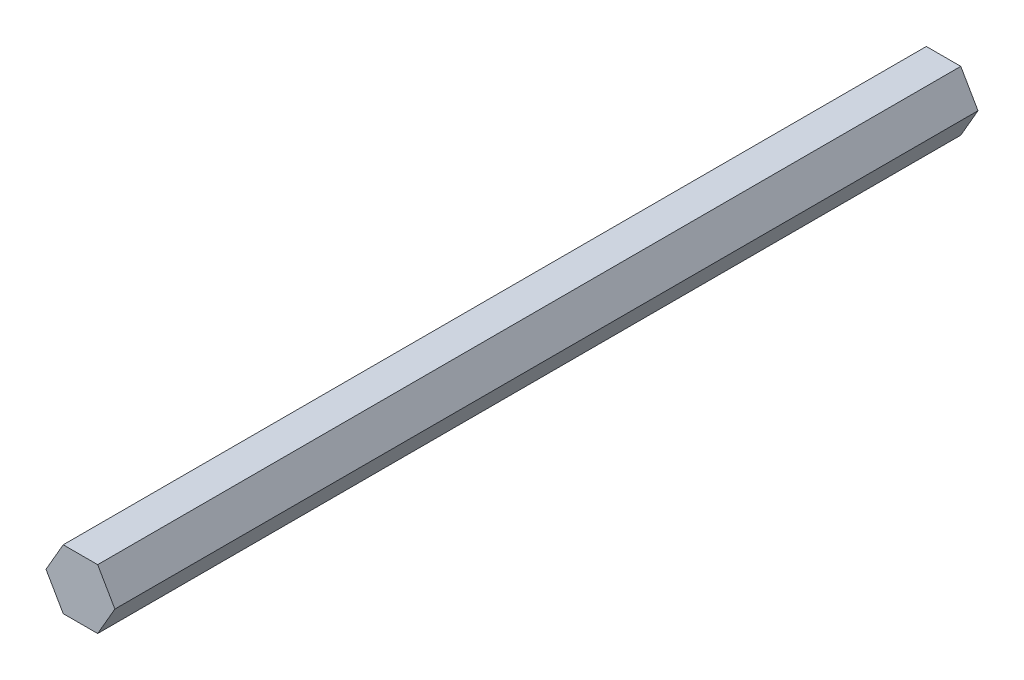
ISO-10303-21;
HEADER;
FILE_DESCRIPTION(('STEP AP214'),'2;1');
FILE_NAME('part.step','',(''),(''),'','','');
FILE_SCHEMA(('AUTOMOTIVE_DESIGN { 1 0 10303 214 1 1 1 1 }'));
ENDSEC;
DATA;
#1=APPLICATION_CONTEXT('core data for automotive mechanical design processes');
#2=APPLICATION_PROTOCOL_DEFINITION('international standard','automotive_design',2000,#1);
#3=PRODUCT_CONTEXT('',#1,'mechanical');
#4=PRODUCT('Part','Part','',(#3));
#5=PRODUCT_RELATED_PRODUCT_CATEGORY('part','',(#4));
#6=PRODUCT_DEFINITION_FORMATION('','',#4);
#7=PRODUCT_DEFINITION_CONTEXT('part definition',#1,'design');
#8=PRODUCT_DEFINITION('design','',#6,#7);
#9=PRODUCT_DEFINITION_SHAPE('','',#8);
#10=(LENGTH_UNIT() NAMED_UNIT(*) SI_UNIT(.MILLI.,.METRE.));
#11=(NAMED_UNIT(*) PLANE_ANGLE_UNIT() SI_UNIT($,.RADIAN.));
#12=(NAMED_UNIT(*) SI_UNIT($,.STERADIAN.) SOLID_ANGLE_UNIT());
#13=UNCERTAINTY_MEASURE_WITH_UNIT(LENGTH_MEASURE(1.E-05),#10,'distance_accuracy_value','');
#14=(GEOMETRIC_REPRESENTATION_CONTEXT(3) GLOBAL_UNCERTAINTY_ASSIGNED_CONTEXT((#13)) GLOBAL_UNIT_ASSIGNED_CONTEXT((#10,
#11,#12)) REPRESENTATION_CONTEXT('',''));
#15=CARTESIAN_POINT('',(0.,0.,0.));
#16=DIRECTION('',(0.,0.,1.));
#17=DIRECTION('',(1.,0.,0.));
#18=AXIS2_PLACEMENT_3D('',#15,#16,#17);
#19=CARTESIAN_POINT('',(1.35677313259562,2.35,0.));
#20=DIRECTION('',(0.866025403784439,0.5,0.));
#21=DIRECTION('',(-0.5,0.866025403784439,0.));
#22=AXIS2_PLACEMENT_3D('',#19,#20,#21);
#23=PLANE('',#22);
#24=DIRECTION('',(-0.5,0.866025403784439,0.));
#25=VECTOR('',#24,1.);
#26=CARTESIAN_POINT('',(2.71354626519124,0.,0.));
#27=LINE('',#26,#25);
#28=CARTESIAN_POINT('',(2.71354626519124,0.,0.));
#29=VERTEX_POINT('',#28);
#30=CARTESIAN_POINT('',(1.35677313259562,2.35,0.));
#31=VERTEX_POINT('',#30);
#32=EDGE_CURVE('E103',#29,#31,#27,.T.);
#33=ORIENTED_EDGE('',*,*,#32,.T.);
#34=DIRECTION('',(0.,0.,1.));
#35=VECTOR('',#34,1.);
#36=CARTESIAN_POINT('',(1.35677313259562,2.35,0.));
#37=LINE('',#36,#35);
#38=CARTESIAN_POINT('',(1.35677313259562,2.35,68.));
#39=VERTEX_POINT('',#38);
#40=EDGE_CURVE('E78',#39,#31,#37,.F.);
#41=ORIENTED_EDGE('',*,*,#40,.F.);
#42=DIRECTION('',(-0.5,0.866025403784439,0.));
#43=VECTOR('',#42,1.);
#44=CARTESIAN_POINT('',(2.71354626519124,0.,68.));
#45=LINE('',#44,#43);
#46=CARTESIAN_POINT('',(2.71354626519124,0.,68.));
#47=VERTEX_POINT('',#46);
#48=EDGE_CURVE('E74',#47,#39,#45,.T.);
#49=ORIENTED_EDGE('',*,*,#48,.F.);
#50=DIRECTION('',(0.,0.,1.));
#51=VECTOR('',#50,1.);
#52=CARTESIAN_POINT('',(2.71354626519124,0.,0.));
#53=LINE('',#52,#51);
#54=EDGE_CURVE('E76',#29,#47,#53,.T.);
#55=ORIENTED_EDGE('',*,*,#54,.F.);
#56=EDGE_LOOP('',(#33,#41,#49,#55));
#57=FACE_BOUND('',#56,.T.);
#58=ADVANCED_FACE('F15',(#57),#23,.T.);
#59=CARTESIAN_POINT('',(-1.35677313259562,2.35,0.));
#60=DIRECTION('',(0.,1.,0.));
#61=DIRECTION('',(0.,0.,1.));
#62=AXIS2_PLACEMENT_3D('',#59,#60,#61);
#63=PLANE('',#62);
#64=DIRECTION('',(1.,0.,0.));
#65=VECTOR('',#64,1.);
#66=CARTESIAN_POINT('',(0.,2.35,0.));
#67=LINE('',#66,#65);
#68=CARTESIAN_POINT('',(-1.35677313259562,2.35,0.));
#69=VERTEX_POINT('',#68);
#70=EDGE_CURVE('E100',#31,#69,#67,.F.);
#71=ORIENTED_EDGE('',*,*,#70,.T.);
#72=DIRECTION('',(0.,0.,1.));
#73=VECTOR('',#72,1.);
#74=CARTESIAN_POINT('',(-1.35677313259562,2.35,0.));
#75=LINE('',#74,#73);
#76=CARTESIAN_POINT('',(-1.35677313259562,2.35,68.));
#77=VERTEX_POINT('',#76);
#78=EDGE_CURVE('E93',#77,#69,#75,.F.);
#79=ORIENTED_EDGE('',*,*,#78,.F.);
#80=DIRECTION('',(1.,0.,0.));
#81=VECTOR('',#80,1.);
#82=CARTESIAN_POINT('',(0.,2.35,68.));
#83=LINE('',#82,#81);
#84=EDGE_CURVE('E81',#39,#77,#83,.F.);
#85=ORIENTED_EDGE('',*,*,#84,.F.);
#86=ORIENTED_EDGE('',*,*,#40,.T.);
#87=EDGE_LOOP('',(#71,#79,#85,#86));
#88=FACE_BOUND('',#87,.T.);
#89=ADVANCED_FACE('F135',(#88),#63,.T.);
#90=CARTESIAN_POINT('',(2.71354626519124,0.,0.));
#91=DIRECTION('',(0.866025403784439,-0.5,0.));
#92=DIRECTION('',(0.5,0.866025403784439,0.));
#93=AXIS2_PLACEMENT_3D('',#90,#91,#92);
#94=PLANE('',#93);
#95=DIRECTION('',(0.5,0.866025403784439,0.));
#96=VECTOR('',#95,1.);
#97=CARTESIAN_POINT('',(1.35677313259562,-2.35,0.));
#98=LINE('',#97,#96);
#99=CARTESIAN_POINT('',(1.35677313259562,-2.35,0.));
#100=VERTEX_POINT('',#99);
#101=EDGE_CURVE('E51',#100,#29,#98,.T.);
#102=ORIENTED_EDGE('',*,*,#101,.T.);
#103=ORIENTED_EDGE('',*,*,#54,.T.);
#104=DIRECTION('',(0.5,0.866025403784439,0.));
#105=VECTOR('',#104,1.);
#106=CARTESIAN_POINT('',(1.35677313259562,-2.35,68.));
#107=LINE('',#106,#105);
#108=CARTESIAN_POINT('',(1.35677313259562,-2.35,68.));
#109=VERTEX_POINT('',#108);
#110=EDGE_CURVE('E85',#109,#47,#107,.T.);
#111=ORIENTED_EDGE('',*,*,#110,.F.);
#112=DIRECTION('',(0.,0.,-1.));
#113=VECTOR('',#112,1.);
#114=CARTESIAN_POINT('',(1.35677313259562,-2.35,0.));
#115=LINE('',#114,#113);
#116=EDGE_CURVE('E107',#100,#109,#115,.F.);
#117=ORIENTED_EDGE('',*,*,#116,.F.);
#118=EDGE_LOOP('',(#102,#103,#111,#117));
#119=FACE_BOUND('',#118,.T.);
#120=ADVANCED_FACE('F84',(#119),#94,.T.);
#121=CARTESIAN_POINT('',(0.,0.,68.));
#122=DIRECTION('',(0.,0.,1.));
#123=DIRECTION('',(1.,0.,0.));
#124=AXIS2_PLACEMENT_3D('',#121,#122,#123);
#125=PLANE('',#124);
#126=DIRECTION('',(1.,0.,0.));
#127=VECTOR('',#126,1.);
#128=CARTESIAN_POINT('',(1.35677313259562,-2.35,68.));
#129=LINE('',#128,#127);
#130=CARTESIAN_POINT('',(-1.35677313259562,-2.35,68.));
#131=VERTEX_POINT('',#130);
#132=EDGE_CURVE('E88',#109,#131,#129,.F.);
#133=ORIENTED_EDGE('',*,*,#132,.F.);
#134=ORIENTED_EDGE('',*,*,#110,.T.);
#135=ORIENTED_EDGE('',*,*,#48,.T.);
#136=ORIENTED_EDGE('',*,*,#84,.T.);
#137=DIRECTION('',(-0.500000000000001,-0.866025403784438,0.));
#138=VECTOR('',#137,1.);
#139=CARTESIAN_POINT('',(-2.71354626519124,0.,68.));
#140=LINE('',#139,#138);
#141=CARTESIAN_POINT('',(-2.71354626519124,0.,68.));
#142=VERTEX_POINT('',#141);
#143=EDGE_CURVE('E90',#142,#77,#140,.F.);
#144=ORIENTED_EDGE('',*,*,#143,.F.);
#145=DIRECTION('',(0.5,-0.866025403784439,0.));
#146=VECTOR('',#145,1.);
#147=CARTESIAN_POINT('',(-1.35677313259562,-2.35,68.));
#148=LINE('',#147,#146);
#149=EDGE_CURVE('E19',#131,#142,#148,.F.);
#150=ORIENTED_EDGE('',*,*,#149,.F.);
#151=EDGE_LOOP('',(#133,#134,#135,#136,#144,#150));
#152=FACE_BOUND('',#151,.T.);
#153=ADVANCED_FACE('F87',(#152),#125,.T.);
#154=CARTESIAN_POINT('',(-2.71354626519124,0.,0.));
#155=DIRECTION('',(-0.866025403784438,0.500000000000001,0.));
#156=DIRECTION('',(-0.500000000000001,-0.866025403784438,0.));
#157=AXIS2_PLACEMENT_3D('',#154,#155,#156);
#158=PLANE('',#157);
#159=DIRECTION('',(-0.500000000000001,-0.866025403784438,0.));
#160=VECTOR('',#159,1.);
#161=CARTESIAN_POINT('',(-1.35677313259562,2.35,0.));
#162=LINE('',#161,#160);
#163=CARTESIAN_POINT('',(-2.71354626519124,0.,0.));
#164=VERTEX_POINT('',#163);
#165=EDGE_CURVE('E98',#69,#164,#162,.T.);
#166=ORIENTED_EDGE('',*,*,#165,.T.);
#167=DIRECTION('',(0.,0.,1.));
#168=VECTOR('',#167,1.);
#169=CARTESIAN_POINT('',(-2.71354626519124,0.,0.));
#170=LINE('',#169,#168);
#171=EDGE_CURVE('E112',#142,#164,#170,.F.);
#172=ORIENTED_EDGE('',*,*,#171,.F.);
#173=ORIENTED_EDGE('',*,*,#143,.T.);
#174=ORIENTED_EDGE('',*,*,#78,.T.);
#175=EDGE_LOOP('',(#166,#172,#173,#174));
#176=FACE_BOUND('',#175,.T.);
#177=ADVANCED_FACE('F125',(#176),#158,.T.);
#178=CARTESIAN_POINT('',(0.,0.,0.));
#179=DIRECTION('',(0.,0.,1.));
#180=DIRECTION('',(1.,0.,0.));
#181=AXIS2_PLACEMENT_3D('',#178,#179,#180);
#182=PLANE('',#181);
#183=ORIENTED_EDGE('',*,*,#32,.F.);
#184=ORIENTED_EDGE('',*,*,#101,.F.);
#185=DIRECTION('',(1.,0.,0.));
#186=VECTOR('',#185,1.);
#187=CARTESIAN_POINT('',(1.35677313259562,-2.35,0.));
#188=LINE('',#187,#186);
#189=CARTESIAN_POINT('',(-1.35677313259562,-2.35,0.));
#190=VERTEX_POINT('',#189);
#191=EDGE_CURVE('E34',#190,#100,#188,.T.);
#192=ORIENTED_EDGE('',*,*,#191,.F.);
#193=DIRECTION('',(0.5,-0.866025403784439,0.));
#194=VECTOR('',#193,1.);
#195=CARTESIAN_POINT('',(-1.35677313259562,-2.35,0.));
#196=LINE('',#195,#194);
#197=EDGE_CURVE('E25',#164,#190,#196,.T.);
#198=ORIENTED_EDGE('',*,*,#197,.F.);
#199=ORIENTED_EDGE('',*,*,#165,.F.);
#200=ORIENTED_EDGE('',*,*,#70,.F.);
#201=EDGE_LOOP('',(#183,#184,#192,#198,#199,#200));
#202=FACE_BOUND('',#201,.T.);
#203=ADVANCED_FACE('F119',(#202),#182,.F.);
#204=CARTESIAN_POINT('',(1.35677313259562,-2.35,0.));
#205=DIRECTION('',(0.,-1.,0.));
#206=DIRECTION('',(0.,0.,-1.));
#207=AXIS2_PLACEMENT_3D('',#204,#205,#206);
#208=PLANE('',#207);
#209=ORIENTED_EDGE('',*,*,#191,.T.);
#210=ORIENTED_EDGE('',*,*,#116,.T.);
#211=ORIENTED_EDGE('',*,*,#132,.T.);
#212=DIRECTION('',(0.,0.,1.));
#213=VECTOR('',#212,1.);
#214=CARTESIAN_POINT('',(-1.35677313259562,-2.35,0.));
#215=LINE('',#214,#213);
#216=EDGE_CURVE('E10',#190,#131,#215,.T.);
#217=ORIENTED_EDGE('',*,*,#216,.F.);
#218=EDGE_LOOP('',(#209,#210,#211,#217));
#219=FACE_BOUND('',#218,.T.);
#220=ADVANCED_FACE('F117',(#219),#208,.T.);
#221=CARTESIAN_POINT('',(-1.35677313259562,-2.35,0.));
#222=DIRECTION('',(-0.866025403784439,-0.5,0.));
#223=DIRECTION('',(0.5,-0.866025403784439,0.));
#224=AXIS2_PLACEMENT_3D('',#221,#222,#223);
#225=PLANE('',#224);
#226=ORIENTED_EDGE('',*,*,#197,.T.);
#227=ORIENTED_EDGE('',*,*,#216,.T.);
#228=ORIENTED_EDGE('',*,*,#149,.T.);
#229=ORIENTED_EDGE('',*,*,#171,.T.);
#230=EDGE_LOOP('',(#226,#227,#228,#229));
#231=FACE_BOUND('',#230,.T.);
#232=ADVANCED_FACE('F17',(#231),#225,.T.);
#233=CLOSED_SHELL('',(#58,#89,#120,#153,#177,#203,#220,#232));
#234=MANIFOLD_SOLID_BREP('B1',#233);
#235=ADVANCED_BREP_SHAPE_REPRESENTATION('',(#18,#234),#14);
#236=SHAPE_DEFINITION_REPRESENTATION(#9,#235);
ENDSEC;
END-ISO-10303-21;
